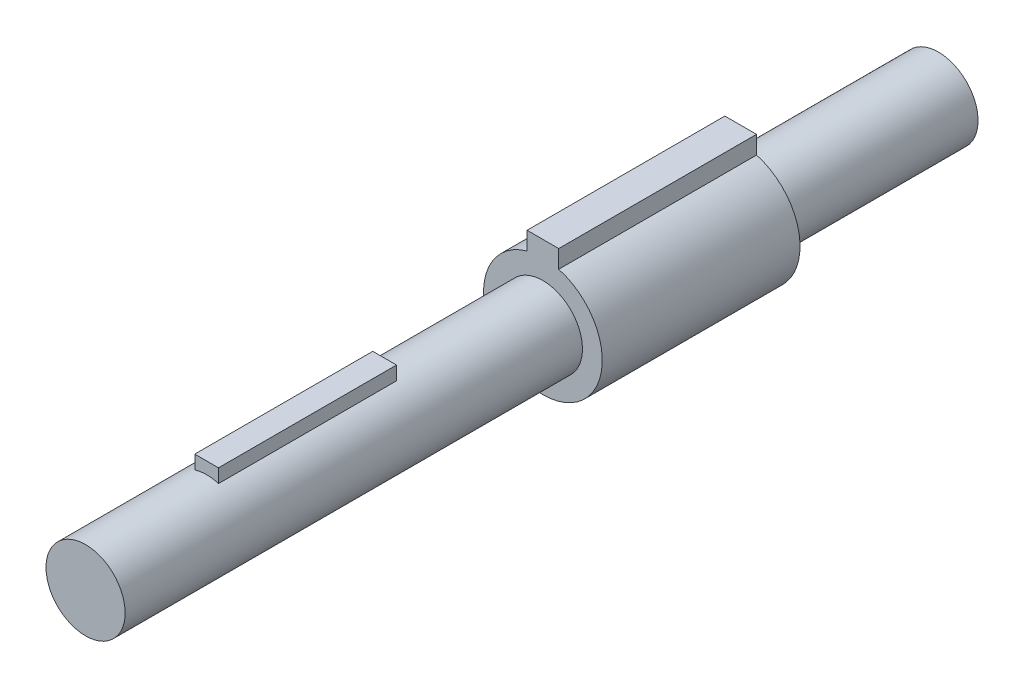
ISO-10303-21;
HEADER;
FILE_DESCRIPTION(('STEP AP214'),'2;1');
FILE_NAME('part.step','',(''),(''),'','','');
FILE_SCHEMA(('AUTOMOTIVE_DESIGN { 1 0 10303 214 1 1 1 1 }'));
ENDSEC;
DATA;
#1=APPLICATION_CONTEXT('core data for automotive mechanical design processes');
#2=APPLICATION_PROTOCOL_DEFINITION('international standard','automotive_design',2000,#1);
#3=PRODUCT_CONTEXT('',#1,'mechanical');
#4=PRODUCT('Part','Part','',(#3));
#5=PRODUCT_RELATED_PRODUCT_CATEGORY('part','',(#4));
#6=PRODUCT_DEFINITION_FORMATION('','',#4);
#7=PRODUCT_DEFINITION_CONTEXT('part definition',#1,'design');
#8=PRODUCT_DEFINITION('design','',#6,#7);
#9=PRODUCT_DEFINITION_SHAPE('','',#8);
#10=(LENGTH_UNIT() NAMED_UNIT(*) SI_UNIT(.MILLI.,.METRE.));
#11=(NAMED_UNIT(*) PLANE_ANGLE_UNIT() SI_UNIT($,.RADIAN.));
#12=(NAMED_UNIT(*) SI_UNIT($,.STERADIAN.) SOLID_ANGLE_UNIT());
#13=UNCERTAINTY_MEASURE_WITH_UNIT(LENGTH_MEASURE(1.E-05),#10,'distance_accuracy_value','');
#14=(GEOMETRIC_REPRESENTATION_CONTEXT(3) GLOBAL_UNCERTAINTY_ASSIGNED_CONTEXT((#13)) GLOBAL_UNIT_ASSIGNED_CONTEXT((#10,
#11,#12)) REPRESENTATION_CONTEXT('',''));
#15=CARTESIAN_POINT('',(0.,0.,0.));
#16=DIRECTION('',(0.,0.,1.));
#17=DIRECTION('',(1.,0.,0.));
#18=AXIS2_PLACEMENT_3D('',#15,#16,#17);
#19=CARTESIAN_POINT('',(0.,0.,0.));
#20=DIRECTION('',(0.,0.,1.));
#21=DIRECTION('',(1.,0.,0.));
#22=AXIS2_PLACEMENT_3D('',#19,#20,#21);
#23=PLANE('',#22);
#24=CARTESIAN_POINT('',(0.,0.,0.));
#25=DIRECTION('',(0.,0.,-1.));
#26=DIRECTION('',(-1.,0.,0.));
#27=AXIS2_PLACEMENT_3D('',#24,#25,#26);
#28=CIRCLE('',#27,12.7);
#29=CARTESIAN_POINT('',(-3.81,12.1150278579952,0.));
#30=VERTEX_POINT('',#29);
#31=CARTESIAN_POINT('',(3.81,12.1150278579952,0.));
#32=VERTEX_POINT('',#31);
#33=EDGE_CURVE('E73',#30,#32,#28,.T.);
#34=ORIENTED_EDGE('',*,*,#33,.F.);
#35=DIRECTION('',(0.,-1.,0.));
#36=VECTOR('',#35,1.);
#37=CARTESIAN_POINT('',(-3.81,16.51,0.));
#38=LINE('',#37,#36);
#39=CARTESIAN_POINT('',(-3.81,16.51,0.));
#40=VERTEX_POINT('',#39);
#41=EDGE_CURVE('E152',#40,#30,#38,.T.);
#42=ORIENTED_EDGE('',*,*,#41,.F.);
#43=DIRECTION('',(-1.,0.,0.));
#44=VECTOR('',#43,1.);
#45=CARTESIAN_POINT('',(3.81,16.51,0.));
#46=LINE('',#45,#44);
#47=CARTESIAN_POINT('',(3.81,16.51,0.));
#48=VERTEX_POINT('',#47);
#49=EDGE_CURVE('E66',#48,#40,#46,.T.);
#50=ORIENTED_EDGE('',*,*,#49,.F.);
#51=DIRECTION('',(0.,1.,0.));
#52=VECTOR('',#51,1.);
#53=CARTESIAN_POINT('',(3.81,16.51,0.));
#54=LINE('',#53,#52);
#55=EDGE_CURVE('E147',#32,#48,#54,.T.);
#56=ORIENTED_EDGE('',*,*,#55,.F.);
#57=EDGE_LOOP('',(#34,#42,#50,#56));
#58=FACE_BOUND('',#57,.T.);
#59=ADVANCED_FACE('F34',(#58),#23,.F.);
#60=CARTESIAN_POINT('',(3.81,16.51,57.15));
#61=DIRECTION('',(-1.,0.,0.));
#62=DIRECTION('',(0.,-1.,0.));
#63=AXIS2_PLACEMENT_3D('',#60,#61,#62);
#64=PLANE('',#63);
#65=ORIENTED_EDGE('',*,*,#55,.T.);
#66=DIRECTION('',(0.,0.,-1.));
#67=VECTOR('',#66,1.);
#68=CARTESIAN_POINT('',(3.81,16.51,57.15));
#69=LINE('',#68,#67);
#70=CARTESIAN_POINT('',(3.81,16.51,57.15));
#71=VERTEX_POINT('',#70);
#72=EDGE_CURVE('E38',#71,#48,#69,.T.);
#73=ORIENTED_EDGE('',*,*,#72,.F.);
#74=DIRECTION('',(0.,1.,0.));
#75=VECTOR('',#74,1.);
#76=CARTESIAN_POINT('',(3.81,16.51,57.15));
#77=LINE('',#76,#75);
#78=CARTESIAN_POINT('',(3.81,12.1150278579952,57.15));
#79=VERTEX_POINT('',#78);
#80=EDGE_CURVE('E150',#79,#71,#77,.T.);
#81=ORIENTED_EDGE('',*,*,#80,.F.);
#82=DIRECTION('',(0.,0.,-1.));
#83=VECTOR('',#82,1.);
#84=CARTESIAN_POINT('',(3.81,12.1150278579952,57.15));
#85=LINE('',#84,#83);
#86=EDGE_CURVE('E155',#79,#32,#85,.T.);
#87=ORIENTED_EDGE('',*,*,#86,.T.);
#88=EDGE_LOOP('',(#65,#73,#81,#87));
#89=FACE_BOUND('',#88,.T.);
#90=ADVANCED_FACE('F36',(#89),#64,.F.);
#91=CARTESIAN_POINT('',(3.81,16.51,57.15));
#92=DIRECTION('',(0.,-1.,0.));
#93=DIRECTION('',(1.,0.,0.));
#94=AXIS2_PLACEMENT_3D('',#91,#92,#93);
#95=PLANE('',#94);
#96=ORIENTED_EDGE('',*,*,#49,.T.);
#97=DIRECTION('',(0.,0.,-1.));
#98=VECTOR('',#97,1.);
#99=CARTESIAN_POINT('',(-3.81,16.51,57.15));
#100=LINE('',#99,#98);
#101=CARTESIAN_POINT('',(-3.81,16.51,57.15));
#102=VERTEX_POINT('',#101);
#103=EDGE_CURVE('E163',#102,#40,#100,.T.);
#104=ORIENTED_EDGE('',*,*,#103,.F.);
#105=DIRECTION('',(-1.,0.,0.));
#106=VECTOR('',#105,1.);
#107=CARTESIAN_POINT('',(3.81,16.51,57.15));
#108=LINE('',#107,#106);
#109=EDGE_CURVE('E76',#71,#102,#108,.T.);
#110=ORIENTED_EDGE('',*,*,#109,.F.);
#111=ORIENTED_EDGE('',*,*,#72,.T.);
#112=EDGE_LOOP('',(#96,#104,#110,#111));
#113=FACE_BOUND('',#112,.T.);
#114=ADVANCED_FACE('F167',(#113),#95,.F.);
#115=CARTESIAN_POINT('',(-3.81,16.51,57.15));
#116=DIRECTION('',(1.,0.,0.));
#117=DIRECTION('',(0.,1.,0.));
#118=AXIS2_PLACEMENT_3D('',#115,#116,#117);
#119=PLANE('',#118);
#120=ORIENTED_EDGE('',*,*,#41,.T.);
#121=DIRECTION('',(0.,0.,-1.));
#122=VECTOR('',#121,1.);
#123=CARTESIAN_POINT('',(-3.81,12.1150278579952,57.15));
#124=LINE('',#123,#122);
#125=CARTESIAN_POINT('',(-3.81,12.1150278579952,57.15));
#126=VERTEX_POINT('',#125);
#127=EDGE_CURVE('E162',#126,#30,#124,.T.);
#128=ORIENTED_EDGE('',*,*,#127,.F.);
#129=DIRECTION('',(0.,-1.,0.));
#130=VECTOR('',#129,1.);
#131=CARTESIAN_POINT('',(-3.81,16.51,57.15));
#132=LINE('',#131,#130);
#133=EDGE_CURVE('E52',#102,#126,#132,.T.);
#134=ORIENTED_EDGE('',*,*,#133,.F.);
#135=ORIENTED_EDGE('',*,*,#103,.T.);
#136=EDGE_LOOP('',(#120,#128,#134,#135));
#137=FACE_BOUND('',#136,.T.);
#138=ADVANCED_FACE('F171',(#137),#119,.F.);
#139=CARTESIAN_POINT('',(0.,0.,57.15));
#140=DIRECTION('',(0.,0.,-1.));
#141=DIRECTION('',(-1.,0.,0.));
#142=AXIS2_PLACEMENT_3D('',#139,#140,#141);
#143=CYLINDRICAL_SURFACE('',#142,12.7);
#144=ORIENTED_EDGE('',*,*,#127,.T.);
#145=ORIENTED_EDGE('',*,*,#33,.T.);
#146=ORIENTED_EDGE('',*,*,#86,.F.);
#147=CARTESIAN_POINT('',(0.,0.,57.15));
#148=DIRECTION('',(0.,0.,1.));
#149=DIRECTION('',(1.,0.,0.));
#150=AXIS2_PLACEMENT_3D('',#147,#148,#149);
#151=CIRCLE('',#150,12.7);
#152=EDGE_CURVE('E142',#79,#126,#151,.T.);
#153=ORIENTED_EDGE('',*,*,#152,.T.);
#154=EDGE_LOOP('',(#144,#145,#146,#153));
#155=FACE_BOUND('',#154,.T.);
#156=CARTESIAN_POINT('',(0.,0.,96.012));
#157=DIRECTION('',(0.,0.,1.));
#158=DIRECTION('',(1.,0.,0.));
#159=AXIS2_PLACEMENT_3D('',#156,#157,#158);
#160=CIRCLE('',#159,12.7);
#161=CARTESIAN_POINT('',(12.7,0.,96.012));
#162=VERTEX_POINT('',#161);
#163=EDGE_CURVE('E144',#162,#162,#160,.T.);
#164=ORIENTED_EDGE('',*,*,#163,.F.);
#165=EDGE_LOOP('',(#164));
#166=FACE_BOUND('',#165,.T.);
#167=CARTESIAN_POINT('',(0.,0.,-50.8));
#168=DIRECTION('',(0.,0.,-1.));
#169=DIRECTION('',(-1.,0.,0.));
#170=AXIS2_PLACEMENT_3D('',#167,#168,#169);
#171=CIRCLE('',#170,12.7);
#172=CARTESIAN_POINT('',(-12.7,0.,-50.8));
#173=VERTEX_POINT('',#172);
#174=EDGE_CURVE('E135',#173,#173,#171,.T.);
#175=ORIENTED_EDGE('',*,*,#174,.F.);
#176=EDGE_LOOP('',(#175));
#177=FACE_BOUND('',#176,.T.);
#178=ADVANCED_FACE('F172',(#155,#166,#177),#143,.T.);
#179=CARTESIAN_POINT('',(0.,0.,57.15));
#180=DIRECTION('',(0.,0.,1.));
#181=DIRECTION('',(1.,0.,0.));
#182=AXIS2_PLACEMENT_3D('',#179,#180,#181);
#183=PLANE('',#182);
#184=ORIENTED_EDGE('',*,*,#152,.F.);
#185=ORIENTED_EDGE('',*,*,#80,.T.);
#186=ORIENTED_EDGE('',*,*,#109,.T.);
#187=ORIENTED_EDGE('',*,*,#133,.T.);
#188=EDGE_LOOP('',(#184,#185,#186,#187));
#189=FACE_BOUND('',#188,.T.);
#190=ADVANCED_FACE('F174',(#189),#183,.T.);
#191=CARTESIAN_POINT('',(0.,0.,96.012));
#192=DIRECTION('',(0.,0.,1.));
#193=DIRECTION('',(1.,0.,0.));
#194=AXIS2_PLACEMENT_3D('',#191,#192,#193);
#195=PLANE('',#194);
#196=ORIENTED_EDGE('',*,*,#163,.T.);
#197=EDGE_LOOP('',(#196));
#198=FACE_BOUND('',#197,.T.);
#199=ADVANCED_FACE('F176',(#198),#195,.T.);
#200=CARTESIAN_POINT('',(0.,0.,-114.3));
#201=DIRECTION('',(0.,0.,1.));
#202=DIRECTION('',(1.,0.,0.));
#203=AXIS2_PLACEMENT_3D('',#200,#201,#202);
#204=CYLINDRICAL_SURFACE('',#203,19.05);
#205=CARTESIAN_POINT('',(0.,0.,-50.8));
#206=DIRECTION('',(0.,0.,-1.));
#207=DIRECTION('',(-1.,0.,0.));
#208=AXIS2_PLACEMENT_3D('',#205,#206,#207);
#209=CIRCLE('',#208,19.05);
#210=CARTESIAN_POINT('',(5.08,18.3601770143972,-50.8));
#211=VERTEX_POINT('',#210);
#212=CARTESIAN_POINT('',(-5.08,18.3601770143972,-50.8));
#213=VERTEX_POINT('',#212);
#214=EDGE_CURVE('E133',#211,#213,#209,.T.);
#215=ORIENTED_EDGE('',*,*,#214,.T.);
#216=DIRECTION('',(0.,0.,1.));
#217=VECTOR('',#216,1.);
#218=CARTESIAN_POINT('',(-5.08,18.3601770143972,-114.3));
#219=LINE('',#218,#217);
#220=CARTESIAN_POINT('',(-5.08,18.3601770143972,-114.3));
#221=VERTEX_POINT('',#220);
#222=EDGE_CURVE('E113',#221,#213,#219,.T.);
#223=ORIENTED_EDGE('',*,*,#222,.F.);
#224=CARTESIAN_POINT('',(0.,0.,-114.3));
#225=DIRECTION('',(0.,0.,-1.));
#226=DIRECTION('',(-1.,0.,0.));
#227=AXIS2_PLACEMENT_3D('',#224,#225,#226);
#228=CIRCLE('',#227,19.05);
#229=CARTESIAN_POINT('',(5.08,18.3601770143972,-114.3));
#230=VERTEX_POINT('',#229);
#231=EDGE_CURVE('E120',#230,#221,#228,.T.);
#232=ORIENTED_EDGE('',*,*,#231,.F.);
#233=DIRECTION('',(0.,0.,1.));
#234=VECTOR('',#233,1.);
#235=CARTESIAN_POINT('',(5.08,18.3601770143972,-114.3));
#236=LINE('',#235,#234);
#237=EDGE_CURVE('E294',#230,#211,#236,.T.);
#238=ORIENTED_EDGE('',*,*,#237,.T.);
#239=EDGE_LOOP('',(#215,#223,#232,#238));
#240=FACE_BOUND('',#239,.T.);
#241=ADVANCED_FACE('F131',(#240),#204,.T.);
#242=CARTESIAN_POINT('',(-5.08,24.13,-114.3));
#243=DIRECTION('',(1.,0.,0.));
#244=DIRECTION('',(0.,0.,-1.));
#245=AXIS2_PLACEMENT_3D('',#242,#243,#244);
#246=PLANE('',#245);
#247=DIRECTION('',(0.,1.,0.));
#248=VECTOR('',#247,1.);
#249=CARTESIAN_POINT('',(-5.08,24.13,-50.8));
#250=LINE('',#249,#248);
#251=CARTESIAN_POINT('',(-5.08,24.13,-50.8));
#252=VERTEX_POINT('',#251);
#253=EDGE_CURVE('E290',#213,#252,#250,.T.);
#254=ORIENTED_EDGE('',*,*,#253,.T.);
#255=DIRECTION('',(0.,0.,1.));
#256=VECTOR('',#255,1.);
#257=CARTESIAN_POINT('',(-5.08,24.13,-114.3));
#258=LINE('',#257,#256);
#259=CARTESIAN_POINT('',(-5.08,24.13,-114.3));
#260=VERTEX_POINT('',#259);
#261=EDGE_CURVE('E116',#260,#252,#258,.T.);
#262=ORIENTED_EDGE('',*,*,#261,.F.);
#263=DIRECTION('',(0.,1.,0.));
#264=VECTOR('',#263,1.);
#265=CARTESIAN_POINT('',(-5.08,24.13,-114.3));
#266=LINE('',#265,#264);
#267=EDGE_CURVE('E109',#221,#260,#266,.T.);
#268=ORIENTED_EDGE('',*,*,#267,.F.);
#269=ORIENTED_EDGE('',*,*,#222,.T.);
#270=EDGE_LOOP('',(#254,#262,#268,#269));
#271=FACE_BOUND('',#270,.T.);
#272=ADVANCED_FACE('F111',(#271),#246,.F.);
#273=CARTESIAN_POINT('',(-5.08,24.13,-114.3));
#274=DIRECTION('',(0.,-1.,0.));
#275=DIRECTION('',(0.,0.,-1.));
#276=AXIS2_PLACEMENT_3D('',#273,#274,#275);
#277=PLANE('',#276);
#278=DIRECTION('',(1.,0.,0.));
#279=VECTOR('',#278,1.);
#280=CARTESIAN_POINT('',(-5.08,24.13,-50.8));
#281=LINE('',#280,#279);
#282=CARTESIAN_POINT('',(5.08,24.13,-50.8));
#283=VERTEX_POINT('',#282);
#284=EDGE_CURVE('E297',#252,#283,#281,.T.);
#285=ORIENTED_EDGE('',*,*,#284,.T.);
#286=DIRECTION('',(0.,0.,1.));
#287=VECTOR('',#286,1.);
#288=CARTESIAN_POINT('',(5.08,24.13,-114.3));
#289=LINE('',#288,#287);
#290=CARTESIAN_POINT('',(5.08,24.13,-114.3));
#291=VERTEX_POINT('',#290);
#292=EDGE_CURVE('E137',#291,#283,#289,.T.);
#293=ORIENTED_EDGE('',*,*,#292,.F.);
#294=DIRECTION('',(1.,0.,0.));
#295=VECTOR('',#294,1.);
#296=CARTESIAN_POINT('',(-5.08,24.13,-114.3));
#297=LINE('',#296,#295);
#298=EDGE_CURVE('E119',#260,#291,#297,.T.);
#299=ORIENTED_EDGE('',*,*,#298,.F.);
#300=ORIENTED_EDGE('',*,*,#261,.T.);
#301=EDGE_LOOP('',(#285,#293,#299,#300));
#302=FACE_BOUND('',#301,.T.);
#303=ADVANCED_FACE('F224',(#302),#277,.F.);
#304=CARTESIAN_POINT('',(5.08,24.13,-114.3));
#305=DIRECTION('',(-1.,0.,0.));
#306=DIRECTION('',(0.,-1.,0.));
#307=AXIS2_PLACEMENT_3D('',#304,#305,#306);
#308=PLANE('',#307);
#309=DIRECTION('',(0.,-1.,0.));
#310=VECTOR('',#309,1.);
#311=CARTESIAN_POINT('',(5.08,24.13,-50.8));
#312=LINE('',#311,#310);
#313=EDGE_CURVE('E129',#283,#211,#312,.T.);
#314=ORIENTED_EDGE('',*,*,#313,.T.);
#315=ORIENTED_EDGE('',*,*,#237,.F.);
#316=DIRECTION('',(0.,-1.,0.));
#317=VECTOR('',#316,1.);
#318=CARTESIAN_POINT('',(5.08,24.13,-114.3));
#319=LINE('',#318,#317);
#320=EDGE_CURVE('E125',#291,#230,#319,.T.);
#321=ORIENTED_EDGE('',*,*,#320,.F.);
#322=ORIENTED_EDGE('',*,*,#292,.T.);
#323=EDGE_LOOP('',(#314,#315,#321,#322));
#324=FACE_BOUND('',#323,.T.);
#325=ADVANCED_FACE('F233',(#324),#308,.F.);
#326=CARTESIAN_POINT('',(0.,0.,-114.3));
#327=DIRECTION('',(0.,0.,-1.));
#328=DIRECTION('',(-1.,0.,0.));
#329=AXIS2_PLACEMENT_3D('',#326,#327,#328);
#330=PLANE('',#329);
#331=CARTESIAN_POINT('',(0.,0.,-114.3));
#332=DIRECTION('',(0.,0.,-1.));
#333=DIRECTION('',(-1.,0.,0.));
#334=AXIS2_PLACEMENT_3D('',#331,#332,#333);
#335=CIRCLE('',#334,12.7);
#336=CARTESIAN_POINT('',(-12.7,0.,-114.3));
#337=VERTEX_POINT('',#336);
#338=EDGE_CURVE('E11',#337,#337,#335,.T.);
#339=ORIENTED_EDGE('',*,*,#338,.F.);
#340=EDGE_LOOP('',(#339));
#341=FACE_BOUND('',#340,.T.);
#342=ORIENTED_EDGE('',*,*,#231,.T.);
#343=ORIENTED_EDGE('',*,*,#267,.T.);
#344=ORIENTED_EDGE('',*,*,#298,.T.);
#345=ORIENTED_EDGE('',*,*,#320,.T.);
#346=EDGE_LOOP('',(#342,#343,#344,#345));
#347=FACE_BOUND('',#346,.T.);
#348=ADVANCED_FACE('F123',(#341,#347),#330,.T.);
#349=CARTESIAN_POINT('',(0.,0.,-50.8));
#350=DIRECTION('',(0.,0.,-1.));
#351=DIRECTION('',(-1.,0.,0.));
#352=AXIS2_PLACEMENT_3D('',#349,#350,#351);
#353=PLANE('',#352);
#354=ORIENTED_EDGE('',*,*,#174,.T.);
#355=EDGE_LOOP('',(#354));
#356=FACE_BOUND('',#355,.T.);
#357=ORIENTED_EDGE('',*,*,#214,.F.);
#358=ORIENTED_EDGE('',*,*,#313,.F.);
#359=ORIENTED_EDGE('',*,*,#284,.F.);
#360=ORIENTED_EDGE('',*,*,#253,.F.);
#361=EDGE_LOOP('',(#357,#358,#359,#360));
#362=FACE_BOUND('',#361,.T.);
#363=ADVANCED_FACE('F250',(#356,#362),#353,.F.);
#364=CARTESIAN_POINT('',(0.,0.,-177.8));
#365=DIRECTION('',(0.,0.,1.));
#366=DIRECTION('',(1.,0.,0.));
#367=AXIS2_PLACEMENT_3D('',#364,#365,#366);
#368=CYLINDRICAL_SURFACE('',#367,12.7);
#369=CARTESIAN_POINT('',(0.,0.,-177.8));
#370=DIRECTION('',(0.,0.,-1.));
#371=DIRECTION('',(-1.,0.,0.));
#372=AXIS2_PLACEMENT_3D('',#369,#370,#371);
#373=CIRCLE('',#372,12.7);
#374=CARTESIAN_POINT('',(-12.7,0.,-177.8));
#375=VERTEX_POINT('',#374);
#376=EDGE_CURVE('E288',#375,#375,#373,.T.);
#377=ORIENTED_EDGE('',*,*,#376,.F.);
#378=EDGE_LOOP('',(#377));
#379=FACE_BOUND('',#378,.T.);
#380=ORIENTED_EDGE('',*,*,#338,.T.);
#381=EDGE_LOOP('',(#380));
#382=FACE_BOUND('',#381,.T.);
#383=ADVANCED_FACE('F255',(#379,#382),#368,.T.);
#384=CARTESIAN_POINT('',(0.,0.,-177.8));
#385=DIRECTION('',(0.,0.,-1.));
#386=DIRECTION('',(-1.,0.,0.));
#387=AXIS2_PLACEMENT_3D('',#384,#385,#386);
#388=PLANE('',#387);
#389=ORIENTED_EDGE('',*,*,#376,.T.);
#390=EDGE_LOOP('',(#389));
#391=FACE_BOUND('',#390,.T.);
#392=ADVANCED_FACE('F272',(#391),#388,.T.);
#393=CLOSED_SHELL('',(#59,#90,#114,#138,#178,#190,#199,#241,#272,#303,#325,#348,#363,#383,#392));
#394=MANIFOLD_SOLID_BREP('B2',#393);
#395=ADVANCED_BREP_SHAPE_REPRESENTATION('',(#18,#394),#14);
#396=SHAPE_DEFINITION_REPRESENTATION(#9,#395);
ENDSEC;
END-ISO-10303-21;
